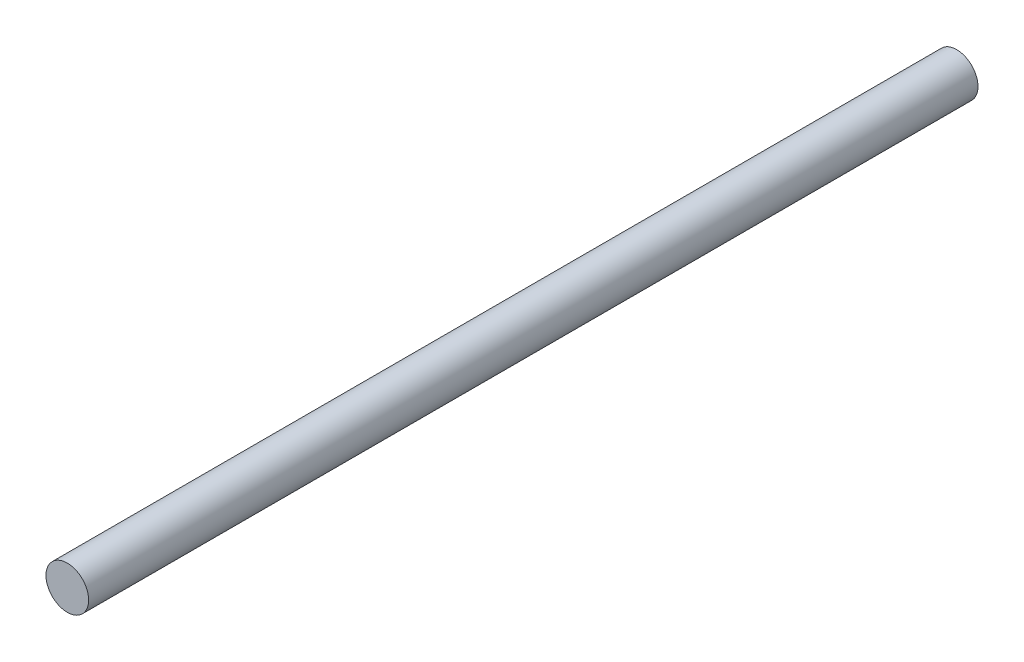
from build123d import *

# Parameters (mm, degrees)
SKETCH1_R           = 30
BOSS_EXTRUDE1_DEPTH = 1250


with BuildPart() as part:
    # Sketch1 → Boss-Extrude1 (new body)
    with BuildSketch(Plane.XY):
        Circle(SKETCH1_R)
    extrude(amount=-BOSS_EXTRUDE1_DEPTH)


solid = part.part
